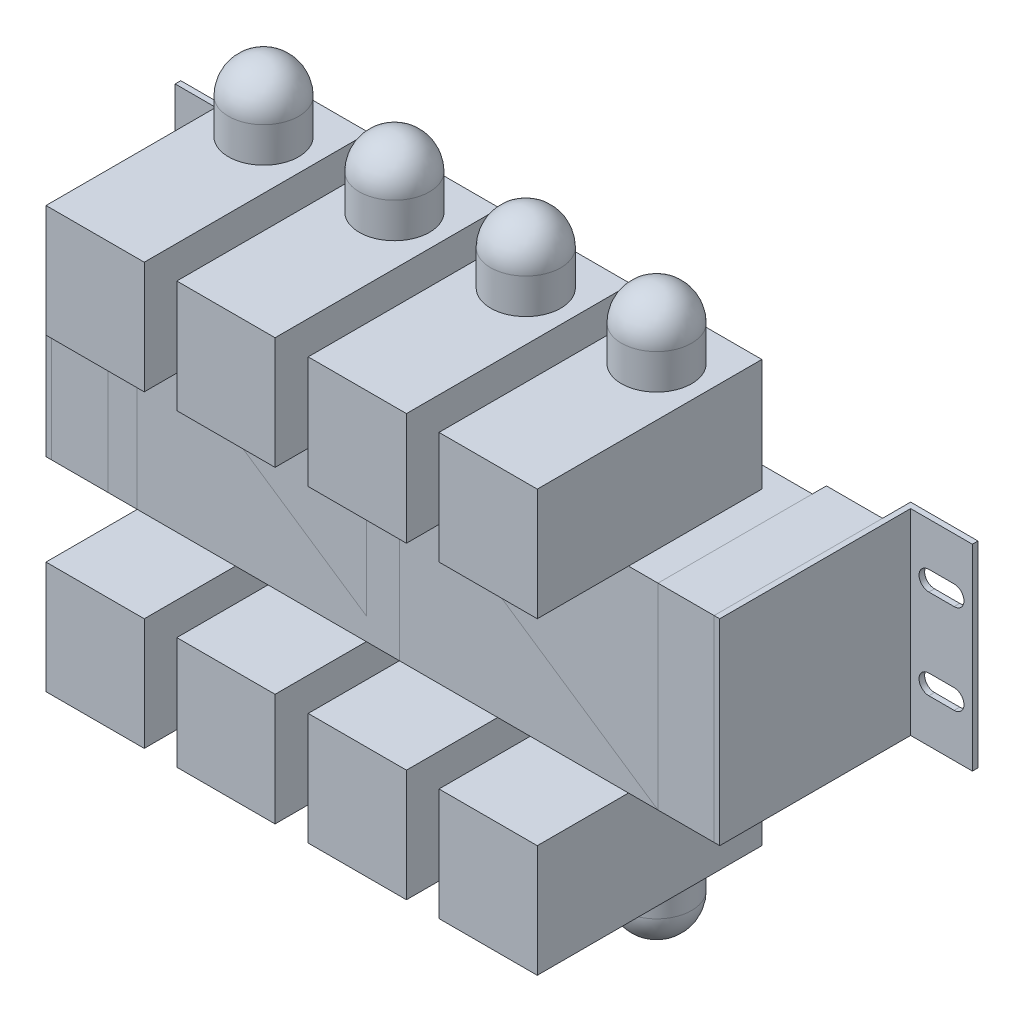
from build123d import *

# Parameters (mm, degrees)
ESQUISSE1_W               = 196
ESQUISSE1_H               = 70
EXTRUSION1_DEPTH          = 55
ESQUISSE2_W               = 60
ESQUISSE2_H               = 70
EXTRUSION2_DEPTH          = 20
EXTRUSION3_DEPTH          = 70
ENL_V_MAT_EXTRU_1_DEPTH   = 162.285461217
ESQUISSE6_W               = 35
ESQUISSE6_H               = 80
EXTRUSION4_DEPTH          = 40
SYM_TRIE3_COPY_1_SKETCH_W = 35
SYM_TRIE3_COPY_1_SKETCH_H = 80
SYM_TRIE3_COPY_1_DEPTH    = 40


with BuildPart() as part:
    # Esquisse1 → Extrusion1 (new body)
    with BuildSketch(Plane.XY):
        Rectangle(ESQUISSE1_W, ESQUISSE1_H)
    extrude(amount=EXTRUSION1_DEPTH)

    # Esquisse6 → Extrusion4 (add)
    with BuildSketch(Plane(origin=(0, 35, 0), x_dir=(-1, 0, 0), z_dir=(0, 1, 0))):
        with Locations((-70, 47.5)):
            Rectangle(ESQUISSE6_W, ESQUISSE6_H)
    extrusion4 = extrude(amount=EXTRUSION4_DEPTH)

    # Esquisse7 → R_volution1 (revolve)
    with BuildSketch(Plane(origin=(70, 0, 0), x_dir=(0, 0, -1), z_dir=(1, 0, 0)), mode=Mode.PRIVATE) as r_volution1_sk:
        with BuildLine():
            Line((-40, 75), (-40, 87.5))
            ThreePointArc((-40, 87.5), (-36.338834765, 96.338834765), (-27.5, 100))
            Line((-27.5, 100), (-27.5, 75))
            Line((-27.5, 75), (-40, 75))
        make_face()
    r_volution1 = revolve(r_volution1_sk.sketch.rotate(Axis((70, 33, 27.5), (0, 1, 0)), 180), axis=Axis((70, 33, 27.5), (0, 1, 0)))

    # Sym_trie2: Extrusion4, R_volution1 across plane
    add(extrusion4.mirror(Plane(origin=(46.7, 0, 0), x_dir=(0, 0, 1), z_dir=(1, 0, 0))))
    add(r_volution1.mirror(Plane(origin=(46.7, 0, 0), x_dir=(0, 0, 1), z_dir=(1, 0, 0))))

    # Sym_trie3: Extrusion4, R_volution1 across plane
    add(extrusion4.mirror(Plane.ZX))
    add(r_volution1.mirror(Plane.ZX))

    # Sym_trie3 copy 1 sketch → Sym_trie3 copy 1 (add)
    with BuildSketch(Plane(origin=(93.4, -35, 0), x_dir=(1, 0, 0), z_dir=(0, -1, 0))):
        with Locations((-70, 47.5)):
            Rectangle(SYM_TRIE3_COPY_1_SKETCH_W, SYM_TRIE3_COPY_1_SKETCH_H)
    extrude(amount=SYM_TRIE3_COPY_1_DEPTH)

    # Sym_trie3 copy 2 sketch → Sym_trie3 copy 2 (revolve)
    with BuildSketch(Plane(origin=(23.4, 0, 0), x_dir=(0, 0, -1), z_dir=(-1, 0, 0))):
        with BuildLine():
            Line((-40, 75), (-40, 87.5))
            ThreePointArc((-40, 87.5), (-36.338834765, 96.338834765), (-27.5, 100))
            Line((-27.5, 100), (-27.5, 75))
            Line((-27.5, 75), (-40, 75))
        make_face()
    revolve(axis=Axis((23.4, -33, 27.5), (0, -1, 0)))


with BuildPart() as body_2:
    # Esquisse2 → Extrusion2 (new body)
    with BuildSketch(Plane(origin=(98, 0, 0), x_dir=(0, 0, -1), z_dir=(1, 0, 0))):
        with Locations((-25, 0)):
            Rectangle(ESQUISSE2_W, ESQUISSE2_H)
    extrude(amount=EXTRUSION2_DEPTH)


with BuildPart() as body_3:
    # Esquisse3 → Extrusion3 (new body)
    with BuildSketch(Plane(origin=(0, 35, 0), x_dir=(-1, 0, 0), z_dir=(0, 1, 0))):
        Polygon((-118, 55), (-118, -15), (-142, -15), (-142, -13), (-120, -13), (-120, 55), align=None)
    extrude(amount=-EXTRUSION3_DEPTH)

    # Esquisse4 → Enl_v. mat.-Extru.1 (cut, through all)
    with BuildSketch(Plane.XY.offset(-13)):
        with BuildLine():
            Line((126.5, 19.5), (135.5, 19.5))
            ThreePointArc((135.5, 19.5), (139, 16), (135.5, 12.5))
            Line((135.5, 12.5), (126.5, 12.5))
            ThreePointArc((126.5, 12.5), (123, 16), (126.5, 19.5))
        make_face()
    enl_v_mat_extru_1 = extrude(amount=-ENL_V_MAT_EXTRU_1_DEPTH, mode=Mode.SUBTRACT)

    # Sym_trie1: Enl_v. mat.-Extru.1 across plane
    add(enl_v_mat_extru_1.mirror(Plane.ZX), mode=Mode.SUBTRACT)


with BuildPart() as body_4:
    # Sym_trie6: mirrored copy
    add(body_3.part.mirror(Plane(origin=(0, 0, 0), x_dir=(0, 0, 1), z_dir=(1, 0, 0))))


with BuildPart() as body_5:
    # Sym_trie6 2: mirrored copy
    add(body_2.part.mirror(Plane(origin=(0, 0, 0), x_dir=(0, 0, 1), z_dir=(1, 0, 0))))


with BuildPart() as body_6:
    # Sym_trie7: mirrored copy
    add(part.part.mirror(Plane(origin=(0, 0, 0), x_dir=(0, 0, 1), z_dir=(1, 0, 0))))


solid = Compound([part.part, body_2.part, body_3.part, body_4.part, body_5.part, body_6.part])
